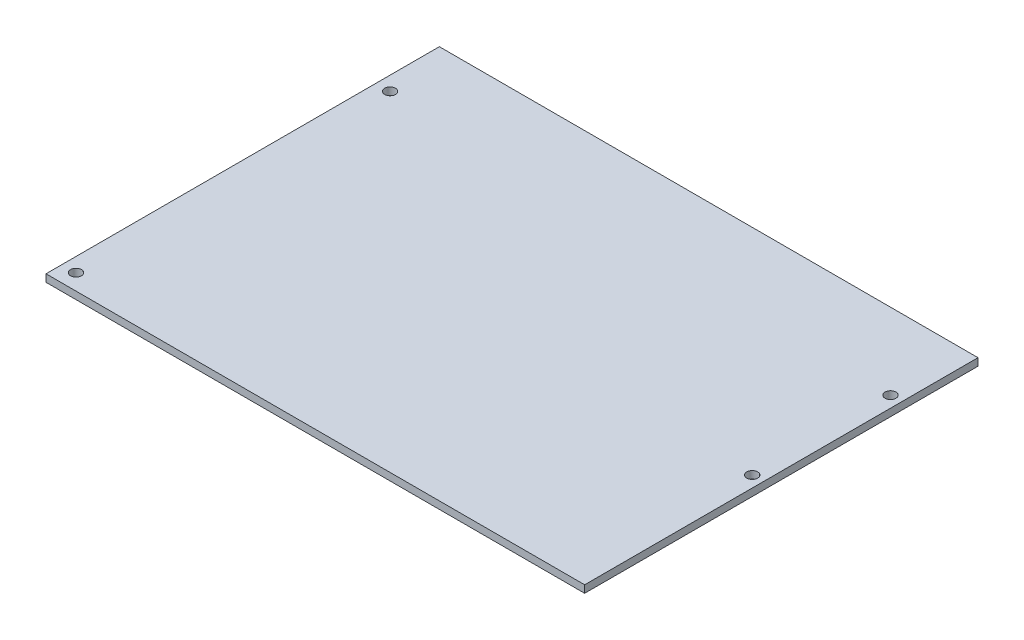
from build123d import *

# Parameters (mm, degrees)
SKETCH1_R      = 1.4732
EXTRUDE1_DEPTH = 2.0066


with BuildPart() as part:
    # Sketch1 → Extrude1 (new body)
    with BuildSketch(Plane(origin=(0, 0, 0), x_dir=(1, 0, 0), z_dir=(0, 1, 0))):
        Polygon((0, 92.5957), (0, 106.5657), (145.9357, 106.5657), (145.9357, 92.5957), (145.9357, 0), (0, 0), align=None)
        with Locations(Location((3.81, 89.408, 0), (0, 0, 270))):
            Circle(SKETCH1_R, mode=Mode.SUBTRACT)
        with Locations(Location((3.81, 4.318, 0), (0, 0, 270))):
            Circle(SKETCH1_R, mode=Mode.SUBTRACT)
        with Locations(Location((142.875, 85.9155, 0), (0, 0, 270))):
            Circle(SKETCH1_R, mode=Mode.SUBTRACT)
        with Locations(Location((142.875, 48.4505, 0), (0, 0, 270))):
            Circle(SKETCH1_R, mode=Mode.SUBTRACT)
    extrude(amount=EXTRUDE1_DEPTH)


solid = part.part
